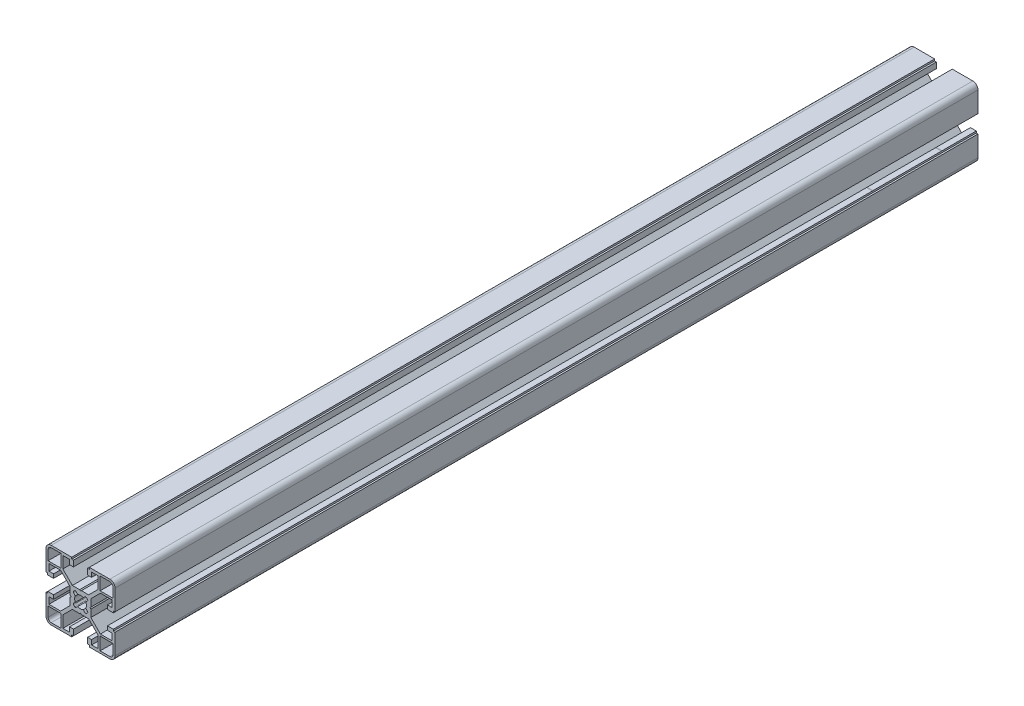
from build123d import *

# Parameters (mm, degrees)
EXTRUDE_1_DEPTH                  = 500
HOLE_WIZARD_8_2_8_2_2_AT_2_COUNT = 2
HOLE_WIZARD_8_2_8_2_2_AT_2_PITCH = 40


with BuildPart() as part:
    # Sketch 1 → Extrude 1 (new body)
    with BuildSketch(Plane.XY):
        with BuildLine():
            Line((-0.898959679, 4.808694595), (-5.12828542, 4.808694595))
            Line((-5.12828542, 4.808694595), (-10.643817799, 10.327112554))
            Line((-10.643817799, 10.327112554), (-10.643817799, 17.112633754))
            Line((-10.643817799, 17.112633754), (-6.795788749, 17.112633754))
            Line((-6.795788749, 17.112633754), (-6.795788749, 14.412633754))
            Line((-6.795788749, 14.412633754), (-4.495788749, 14.412633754))
            Line((-4.495788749, 14.412633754), (-4.495788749, 17.812633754))
            Line((-4.495788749, 17.812633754), (-5.495788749, 17.812633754))
            Line((-5.495788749, 17.812633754), (-5.495788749, 18.812633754))
            Line((-5.495788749, 18.812633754), (-17.395788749, 18.812633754))
            ThreePointArc((-17.395788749, 18.812633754), (-19.517109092, 17.933954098), (-20.395788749, 15.812633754))
            Line((-20.395788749, 15.812633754), (-20.395788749, 3.912633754))
            Line((-20.395788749, 3.912633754), (-19.395788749, 3.912633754))
            Line((-19.395788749, 3.912633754), (-19.395788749, 2.912633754))
            Line((-19.395788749, 2.912633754), (-15.995788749, 2.912633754))
            Line((-15.995788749, 2.912633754), (-15.995788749, 5.205259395))
            Line((-15.995788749, 5.205259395), (-18.695788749, 5.205259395))
            Line((-18.695788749, 5.205259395), (-18.695788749, 9.053290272))
            Line((-18.695788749, 9.053290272), (-11.922644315, 9.053290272))
            Line((-11.922644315, 9.053290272), (-6.395788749, 3.527062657))
            Line((-6.395788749, 3.527062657), (-6.395788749, -0.690507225))
            Line((-6.395788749, -0.690507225), (-5.894885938, -1.191410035))
            Line((-5.894885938, -1.191410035), (-6.395788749, -1.692312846))
            Line((-6.395788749, -1.692312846), (-6.395788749, -5.909882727))
            Line((-6.395788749, -5.909882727), (-11.923272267, -11.437366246))
            Line((-11.923272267, -11.437366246), (-18.695788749, -11.437366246))
            Line((-18.695788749, -11.437366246), (-18.695788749, -7.587366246))
            Line((-18.695788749, -7.587366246), (-15.995788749, -7.587366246))
            Line((-15.995788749, -7.587366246), (-15.995788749, -5.287366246))
            Line((-15.995788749, -5.287366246), (-19.395788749, -5.287366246))
            Line((-19.395788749, -5.287366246), (-19.395788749, -6.287366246))
            Line((-19.395788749, -6.287366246), (-20.395788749, -6.287366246))
            Line((-20.395788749, -6.287366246), (-20.395788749, -18.187366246))
            ThreePointArc((-20.395788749, -18.187366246), (-19.517109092, -20.308686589), (-17.395788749, -21.187366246))
            Line((-17.395788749, -21.187366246), (-5.495788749, -21.187366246))
            Line((-5.495788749, -21.187366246), (-5.495788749, -20.187366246))
            Line((-5.495788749, -20.187366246), (-4.495788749, -20.187366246))
            Line((-4.495788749, -20.187366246), (-4.495788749, -16.787366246))
            Line((-4.495788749, -16.787366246), (-6.795788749, -16.787366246))
            Line((-6.795788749, -16.787366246), (-6.795788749, -19.487366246))
            Line((-6.795788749, -19.487366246), (-10.645788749, -19.487366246))
            Line((-10.645788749, -19.487366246), (-10.645788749, -12.684043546))
            Line((-10.645788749, -12.684043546), (-5.133574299, -7.191305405))
            Line((-5.133574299, -7.191305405), (-0.902292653, -7.191305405))
            Line((-0.902292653, -7.191305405), (-0.403708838, -6.69272159))
            Line((-0.403708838, -6.69272159), (0.094874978, -7.191305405))
            Line((0.094874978, -7.191305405), (4.326156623, -7.191305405))
            Line((4.326156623, -7.191305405), (9.849265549, -12.709841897))
            Line((9.849265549, -12.709841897), (9.849265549, -19.487366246))
            Line((9.849265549, -19.487366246), (6.004211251, -19.487366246))
            Line((6.004211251, -19.487366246), (6.004211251, -16.787366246))
            Line((6.004211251, -16.787366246), (3.704211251, -16.787366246))
            Line((3.704211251, -16.787366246), (3.704211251, -20.187366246))
            Line((3.704211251, -20.187366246), (4.704211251, -20.187366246))
            Line((4.704211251, -20.187366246), (4.704211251, -21.187366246))
            Line((4.704211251, -21.187366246), (16.604211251, -21.187366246))
            ThreePointArc((16.604211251, -21.187366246), (18.725531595, -20.308686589), (19.604211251, -18.187366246))
            Line((19.604211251, -18.187366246), (19.604211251, -6.287366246))
            Line((19.604211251, -6.287366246), (18.598967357, -6.287366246))
            Line((18.598967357, -6.287366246), (18.598967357, -5.287366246))
            Line((18.598967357, -5.287366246), (15.198967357, -5.287366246))
            Line((15.198967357, -5.287366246), (15.198967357, -7.587366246))
            Line((15.198967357, -7.587366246), (17.898967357, -7.587366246))
            Line((17.898967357, -7.587366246), (17.898967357, -11.443275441))
            Line((17.898967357, -11.443275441), (11.122574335, -11.443275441))
            Line((11.122574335, -11.443275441), (5.598967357, -5.91929944))
            Line((5.598967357, -5.91929944), (5.598967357, -1.681479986))
            Line((5.598967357, -1.681479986), (5.10776082, -1.190273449))
            Line((5.10776082, -1.190273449), (5.598967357, -0.699066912))
            Line((5.598967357, -0.699066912), (5.598967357, 3.538752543))
            Line((5.598967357, 3.538752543), (11.121419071, 9.058804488))
            Line((11.121419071, 9.058804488), (17.898967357, 9.058804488))
            Line((17.898967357, 9.058804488), (17.898967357, 5.214714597))
            Line((17.898967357, 5.214714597), (15.198967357, 5.214714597))
            Line((15.198967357, 5.214714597), (15.198967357, 2.914714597))
            Line((15.198967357, 2.914714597), (18.598967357, 2.914714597))
            Line((18.598967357, 2.914714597), (18.598967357, 3.914714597))
            Line((18.598967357, 3.914714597), (19.604211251, 3.914714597))
            Line((19.604211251, 3.914714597), (19.604211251, 15.812633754))
            ThreePointArc((19.604211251, 15.812633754), (18.725531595, 17.933954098), (16.604211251, 18.812633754))
            Line((16.604211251, 18.812633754), (4.704211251, 18.812633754))
            Line((4.704211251, 18.812633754), (4.704211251, 17.812633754))
            Line((4.704211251, 17.812633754), (3.704211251, 17.812633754))
            Line((3.704211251, 17.812633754), (3.704211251, 14.412633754))
            Line((3.704211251, 14.412633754), (6.004211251, 14.412633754))
            Line((6.004211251, 14.412633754), (6.004211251, 17.112633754))
            Line((6.004211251, 17.112633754), (9.852848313, 17.112633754))
            Line((9.852848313, 17.112633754), (9.852848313, 10.346468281))
            Line((9.852848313, 10.346468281), (4.321225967, 4.808694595))
            Line((4.321225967, 4.808694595), (0.091900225, 4.808694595))
            Line((0.091900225, 4.808694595), (-0.403529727, 4.313264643))
            Line((-0.403529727, 4.313264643), (-0.898959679, 4.808694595))
        make_face()
        with BuildLine():
            Line((2.260451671, 2.874558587), (1.199519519, 1.813626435))
            ThreePointArc((1.199519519, 1.813626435), (-0.391198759, 2.208694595), (-1.981917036, 1.813626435))
            Line((-1.981917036, 1.813626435), (-3.042849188, 2.874558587))
            ThreePointArc((-3.042849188, 2.874558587), (-3.396402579, 3.021005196), (-3.749955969, 2.874558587))
            Line((-3.749955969, 2.874558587), (-4.45706275, 2.167451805))
            ThreePointArc((-4.45706275, 2.167451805), (-4.60350936, 1.813898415), (-4.45706275, 1.460345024))
            Line((-4.45706275, 1.460345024), (-3.396130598, 0.399412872))
            ThreePointArc((-3.396130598, 0.399412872), (-3.791198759, -1.191305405), (-3.396130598, -2.782023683))
            Line((-3.396130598, -2.782023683), (-4.45706275, -3.842955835))
            ThreePointArc((-4.45706275, -3.842955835), (-4.60350936, -4.196509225), (-4.45706275, -4.550062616))
            Line((-4.45706275, -4.550062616), (-3.749955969, -5.257169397))
            ThreePointArc((-3.749955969, -5.257169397), (-3.396402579, -5.403616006), (-3.042849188, -5.257169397))
            Line((-3.042849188, -5.257169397), (-1.981917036, -4.196237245))
            ThreePointArc((-1.981917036, -4.196237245), (-0.391198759, -4.591305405), (1.199519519, -4.196237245))
            Line((1.199519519, -4.196237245), (2.260451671, -5.257169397))
            ThreePointArc((2.260451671, -5.257169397), (2.614005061, -5.403616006), (2.967558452, -5.257169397))
            Line((2.967558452, -5.257169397), (3.674665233, -4.550062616))
            ThreePointArc((3.674665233, -4.550062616), (3.821111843, -4.196509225), (3.674665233, -3.842955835))
            Line((3.674665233, -3.842955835), (2.613733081, -2.782023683))
            ThreePointArc((2.613733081, -2.782023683), (3.008801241, -1.191305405), (2.613733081, 0.399412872))
            Line((2.613733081, 0.399412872), (3.674665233, 1.460345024))
            ThreePointArc((3.674665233, 1.460345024), (3.821111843, 1.813898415), (3.674665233, 2.167451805))
            Line((3.674665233, 2.167451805), (2.967558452, 2.874558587))
            ThreePointArc((2.967558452, 2.874558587), (2.614005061, 3.021005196), (2.260451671, 2.874558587))
        make_face(mode=Mode.SUBTRACT)
        with BuildLine():
            Line((10.960771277, 17.612633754), (10.960771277, 10.156723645))
            Line((10.960771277, 10.156723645), (18.408801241, 10.156723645))
            Line((18.408801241, 10.156723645), (18.408801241, 15.812633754))
            ThreePointArc((18.408801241, 15.812633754), (17.881593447, 17.08542596), (16.608801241, 17.612633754))
            Line((16.608801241, 17.612633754), (10.960771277, 17.612633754))
        make_face(mode=Mode.SUBTRACT)
        with BuildLine():
            Line((-19.191198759, 15.812633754), (-19.191198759, 10.160664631))
            Line((-19.191198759, 10.160664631), (-11.739227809, 10.160664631))
            Line((-11.739227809, 10.160664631), (-11.739227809, 17.612633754))
            Line((-11.739227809, 17.612633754), (-17.391198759, 17.612633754))
            ThreePointArc((-17.391198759, 17.612633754), (-18.663990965, 17.08542596), (-19.191198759, 15.812633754))
        make_face(mode=Mode.SUBTRACT)
        with BuildLine():
            Line((-11.741198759, -19.987366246), (-11.741198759, -12.537366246))
            Line((-11.741198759, -12.537366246), (-19.191198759, -12.537366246))
            Line((-19.191198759, -12.537366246), (-19.191198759, -18.187366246))
            ThreePointArc((-19.191198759, -18.187366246), (-18.663990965, -19.460158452), (-17.391198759, -19.987366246))
            Line((-17.391198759, -19.987366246), (-11.741198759, -19.987366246))
        make_face(mode=Mode.SUBTRACT)
        with BuildLine():
            Line((18.408801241, -12.543275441), (10.956830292, -12.543275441))
            Line((10.956830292, -12.543275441), (10.956830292, -19.987366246))
            Line((10.956830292, -19.987366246), (16.608801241, -19.987366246))
            ThreePointArc((16.608801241, -19.987366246), (17.881593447, -19.460158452), (18.408801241, -18.187366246))
            Line((18.408801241, -18.187366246), (18.408801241, -12.543275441))
        make_face(mode=Mode.SUBTRACT)
    extrude(amount=EXTRUDE_1_DEPTH)

    # Sketch 5 → Hole Wizard 8.2 _8.2_2 (revolve, cut)
    with BuildSketch(Plane(origin=(-6.395788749, -1.191410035, 20), x_dir=(0, 0, 1), z_dir=(0, 1, 0))):
        Polygon((0, 0), (0, 28.663528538), (4.1, 26.2), (4.1, 0), align=None)
    hole_wizard_8_2_8_2_2 = revolve(axis=Axis((-12.745788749, -1.191410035, 20), (1, 0, 0)), mode=Mode.SUBTRACT)

    # Hole Wizard 8.2 _8.2_2 at 2: Hole Wizard 8.2 _8.2_2 ×2
    with Locations(*[(0, 0, i * HOLE_WIZARD_8_2_8_2_2_AT_2_PITCH) for i in range(1, HOLE_WIZARD_8_2_8_2_2_AT_2_COUNT)]):
        add(hole_wizard_8_2_8_2_2, mode=Mode.SUBTRACT)


solid = part.part
